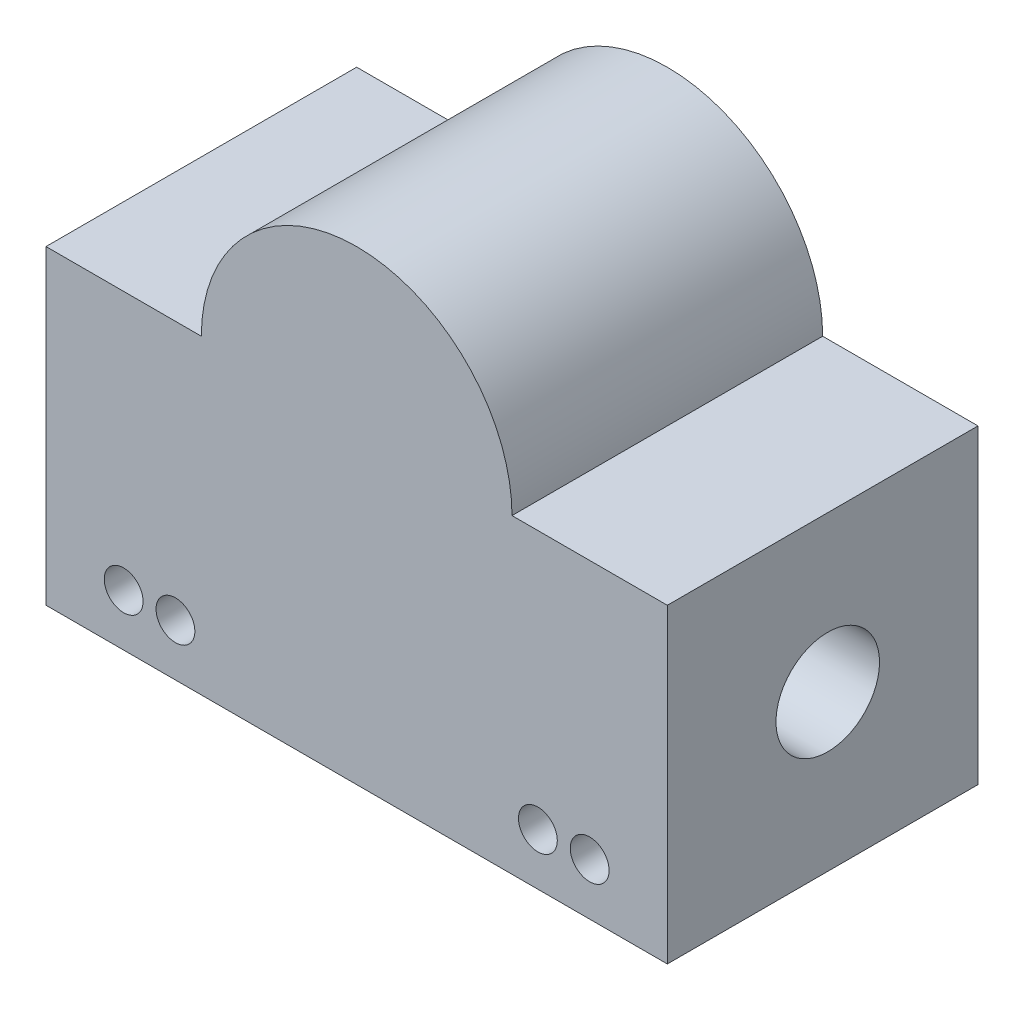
ISO-10303-21;
HEADER;
FILE_DESCRIPTION(('STEP AP214'),'2;1');
FILE_NAME('part.step','',(''),(''),'','','');
FILE_SCHEMA(('AUTOMOTIVE_DESIGN { 1 0 10303 214 1 1 1 1 }'));
ENDSEC;
DATA;
#1=APPLICATION_CONTEXT('core data for automotive mechanical design processes');
#2=APPLICATION_PROTOCOL_DEFINITION('international standard','automotive_design',2000,#1);
#3=PRODUCT_CONTEXT('',#1,'mechanical');
#4=PRODUCT('Part','Part','',(#3));
#5=PRODUCT_RELATED_PRODUCT_CATEGORY('part','',(#4));
#6=PRODUCT_DEFINITION_FORMATION('','',#4);
#7=PRODUCT_DEFINITION_CONTEXT('part definition',#1,'design');
#8=PRODUCT_DEFINITION('design','',#6,#7);
#9=PRODUCT_DEFINITION_SHAPE('','',#8);
#10=(LENGTH_UNIT() NAMED_UNIT(*) SI_UNIT(.MILLI.,.METRE.));
#11=(NAMED_UNIT(*) PLANE_ANGLE_UNIT() SI_UNIT($,.RADIAN.));
#12=(NAMED_UNIT(*) SI_UNIT($,.STERADIAN.) SOLID_ANGLE_UNIT());
#13=UNCERTAINTY_MEASURE_WITH_UNIT(LENGTH_MEASURE(1.E-05),#10,'distance_accuracy_value','');
#14=(GEOMETRIC_REPRESENTATION_CONTEXT(3) GLOBAL_UNCERTAINTY_ASSIGNED_CONTEXT((#13)) GLOBAL_UNIT_ASSIGNED_CONTEXT((#10,
#11,#12)) REPRESENTATION_CONTEXT('',''));
#15=CARTESIAN_POINT('',(0.,0.,0.));
#16=DIRECTION('',(0.,0.,1.));
#17=DIRECTION('',(1.,0.,0.));
#18=AXIS2_PLACEMENT_3D('',#15,#16,#17);
#19=CARTESIAN_POINT('',(0.,0.,38.1));
#20=DIRECTION('',(-1.,0.,0.));
#21=DIRECTION('',(0.,0.,1.));
#22=AXIS2_PLACEMENT_3D('',#19,#20,#21);
#23=PLANE('',#22);
#24=CARTESIAN_POINT('',(0.,19.05,18.4273274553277));
#25=DIRECTION('',(1.,0.,0.));
#26=DIRECTION('',(0.,0.,-1.));
#27=AXIS2_PLACEMENT_3D('',#24,#25,#26);
#28=CIRCLE('',#27,6.35);
#29=CARTESIAN_POINT('',(0.,19.05,12.0773274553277));
#30=VERTEX_POINT('',#29);
#31=EDGE_CURVE('E124',#30,#30,#28,.T.);
#32=ORIENTED_EDGE('',*,*,#31,.T.);
#33=EDGE_LOOP('',(#32));
#34=FACE_BOUND('',#33,.T.);
#35=DIRECTION('',(0.,1.,0.));
#36=VECTOR('',#35,1.);
#37=CARTESIAN_POINT('',(0.,0.,0.));
#38=LINE('',#37,#36);
#39=CARTESIAN_POINT('',(0.,0.,0.));
#40=VERTEX_POINT('',#39);
#41=CARTESIAN_POINT('',(0.,38.1,0.));
#42=VERTEX_POINT('',#41);
#43=EDGE_CURVE('E120',#40,#42,#38,.T.);
#44=ORIENTED_EDGE('',*,*,#43,.F.);
#45=DIRECTION('',(0.,0.,-1.));
#46=VECTOR('',#45,1.);
#47=CARTESIAN_POINT('',(0.,0.,38.1));
#48=LINE('',#47,#46);
#49=CARTESIAN_POINT('',(0.,0.,38.1));
#50=VERTEX_POINT('',#49);
#51=EDGE_CURVE('E11',#50,#40,#48,.T.);
#52=ORIENTED_EDGE('',*,*,#51,.F.);
#53=DIRECTION('',(0.,1.,0.));
#54=VECTOR('',#53,1.);
#55=CARTESIAN_POINT('',(0.,0.,38.1));
#56=LINE('',#55,#54);
#57=CARTESIAN_POINT('',(0.,38.1,38.1));
#58=VERTEX_POINT('',#57);
#59=EDGE_CURVE('E133',#50,#58,#56,.T.);
#60=ORIENTED_EDGE('',*,*,#59,.T.);
#61=DIRECTION('',(0.,0.,-1.));
#62=VECTOR('',#61,1.);
#63=CARTESIAN_POINT('',(0.,38.1,38.1));
#64=LINE('',#63,#62);
#65=EDGE_CURVE('E37',#58,#42,#64,.T.);
#66=ORIENTED_EDGE('',*,*,#65,.T.);
#67=EDGE_LOOP('',(#44,#52,#60,#66));
#68=FACE_BOUND('',#67,.T.);
#69=ADVANCED_FACE('F34',(#34,#68),#23,.T.);
#70=CARTESIAN_POINT('',(0.,0.,38.1));
#71=DIRECTION('',(0.,1.,0.));
#72=DIRECTION('',(0.,0.,1.));
#73=AXIS2_PLACEMENT_3D('',#70,#71,#72);
#74=PLANE('',#73);
#75=DIRECTION('',(1.,0.,0.));
#76=VECTOR('',#75,1.);
#77=CARTESIAN_POINT('',(0.,0.,0.));
#78=LINE('',#77,#76);
#79=CARTESIAN_POINT('',(76.2,0.,0.));
#80=VERTEX_POINT('',#79);
#81=EDGE_CURVE('E73',#40,#80,#78,.T.);
#82=ORIENTED_EDGE('',*,*,#81,.T.);
#83=DIRECTION('',(0.,0.,-1.));
#84=VECTOR('',#83,1.);
#85=CARTESIAN_POINT('',(76.2,0.,38.1));
#86=LINE('',#85,#84);
#87=CARTESIAN_POINT('',(76.2,0.,38.1));
#88=VERTEX_POINT('',#87);
#89=EDGE_CURVE('E43',#88,#80,#86,.T.);
#90=ORIENTED_EDGE('',*,*,#89,.F.);
#91=DIRECTION('',(1.,0.,0.));
#92=VECTOR('',#91,1.);
#93=CARTESIAN_POINT('',(0.,0.,38.1));
#94=LINE('',#93,#92);
#95=EDGE_CURVE('E98',#50,#88,#94,.T.);
#96=ORIENTED_EDGE('',*,*,#95,.F.);
#97=ORIENTED_EDGE('',*,*,#51,.T.);
#98=EDGE_LOOP('',(#82,#90,#96,#97));
#99=FACE_BOUND('',#98,.T.);
#100=ADVANCED_FACE('F204',(#99),#74,.F.);
#101=CARTESIAN_POINT('',(76.2,0.,38.1));
#102=DIRECTION('',(-1.,0.,0.));
#103=DIRECTION('',(0.,0.,1.));
#104=AXIS2_PLACEMENT_3D('',#101,#102,#103);
#105=PLANE('',#104);
#106=CARTESIAN_POINT('',(76.2,19.05,18.4273274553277));
#107=DIRECTION('',(1.,0.,0.));
#108=DIRECTION('',(0.,0.,-1.));
#109=AXIS2_PLACEMENT_3D('',#106,#107,#108);
#110=CIRCLE('',#109,6.35);
#111=CARTESIAN_POINT('',(76.2,19.05,12.0773274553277));
#112=VERTEX_POINT('',#111);
#113=EDGE_CURVE('E146',#112,#112,#110,.T.);
#114=ORIENTED_EDGE('',*,*,#113,.F.);
#115=EDGE_LOOP('',(#114));
#116=FACE_BOUND('',#115,.T.);
#117=DIRECTION('',(0.,1.,0.));
#118=VECTOR('',#117,1.);
#119=CARTESIAN_POINT('',(76.2,0.,0.));
#120=LINE('',#119,#118);
#121=CARTESIAN_POINT('',(76.2,38.1,0.));
#122=VERTEX_POINT('',#121);
#123=EDGE_CURVE('E105',#80,#122,#120,.T.);
#124=ORIENTED_EDGE('',*,*,#123,.T.);
#125=DIRECTION('',(0.,0.,-1.));
#126=VECTOR('',#125,1.);
#127=CARTESIAN_POINT('',(76.2,38.1,38.1));
#128=LINE('',#127,#126);
#129=CARTESIAN_POINT('',(76.2,38.1,38.1));
#130=VERTEX_POINT('',#129);
#131=EDGE_CURVE('E102',#130,#122,#128,.T.);
#132=ORIENTED_EDGE('',*,*,#131,.F.);
#133=DIRECTION('',(0.,1.,0.));
#134=VECTOR('',#133,1.);
#135=CARTESIAN_POINT('',(76.2,0.,38.1));
#136=LINE('',#135,#134);
#137=EDGE_CURVE('E92',#88,#130,#136,.T.);
#138=ORIENTED_EDGE('',*,*,#137,.F.);
#139=ORIENTED_EDGE('',*,*,#89,.T.);
#140=EDGE_LOOP('',(#124,#132,#138,#139));
#141=FACE_BOUND('',#140,.T.);
#142=ADVANCED_FACE('F103',(#116,#141),#105,.F.);
#143=CARTESIAN_POINT('',(57.15,38.1,38.1));
#144=DIRECTION('',(0.,1.,0.));
#145=DIRECTION('',(0.,0.,1.));
#146=AXIS2_PLACEMENT_3D('',#143,#144,#145);
#147=PLANE('',#146);
#148=DIRECTION('',(1.,0.,0.));
#149=VECTOR('',#148,1.);
#150=CARTESIAN_POINT('',(57.15,38.1,0.));
#151=LINE('',#150,#149);
#152=CARTESIAN_POINT('',(57.15,38.1,0.));
#153=VERTEX_POINT('',#152);
#154=EDGE_CURVE('E130',#153,#122,#151,.T.);
#155=ORIENTED_EDGE('',*,*,#154,.F.);
#156=DIRECTION('',(0.,0.,-1.));
#157=VECTOR('',#156,1.);
#158=CARTESIAN_POINT('',(57.15,38.1,38.1));
#159=LINE('',#158,#157);
#160=CARTESIAN_POINT('',(57.15,38.1,38.1));
#161=VERTEX_POINT('',#160);
#162=EDGE_CURVE('E109',#161,#153,#159,.T.);
#163=ORIENTED_EDGE('',*,*,#162,.F.);
#164=DIRECTION('',(1.,0.,0.));
#165=VECTOR('',#164,1.);
#166=CARTESIAN_POINT('',(57.15,38.1,38.1));
#167=LINE('',#166,#165);
#168=EDGE_CURVE('E97',#161,#130,#167,.T.);
#169=ORIENTED_EDGE('',*,*,#168,.T.);
#170=ORIENTED_EDGE('',*,*,#131,.T.);
#171=EDGE_LOOP('',(#155,#163,#169,#170));
#172=FACE_BOUND('',#171,.T.);
#173=ADVANCED_FACE('F111',(#172),#147,.T.);
#174=CARTESIAN_POINT('',(38.1,38.1,38.1));
#175=DIRECTION('',(0.,0.,-1.));
#176=DIRECTION('',(-1.,0.,0.));
#177=AXIS2_PLACEMENT_3D('',#174,#175,#176);
#178=CYLINDRICAL_SURFACE('',#177,19.05);
#179=CARTESIAN_POINT('',(38.1,38.1,0.));
#180=DIRECTION('',(0.,0.,1.));
#181=DIRECTION('',(1.,0.,0.));
#182=AXIS2_PLACEMENT_3D('',#179,#180,#181);
#183=CIRCLE('',#182,19.05);
#184=CARTESIAN_POINT('',(19.05,38.1,0.));
#185=VERTEX_POINT('',#184);
#186=EDGE_CURVE('E127',#153,#185,#183,.T.);
#187=ORIENTED_EDGE('',*,*,#186,.T.);
#188=DIRECTION('',(0.,0.,-1.));
#189=VECTOR('',#188,1.);
#190=CARTESIAN_POINT('',(19.05,38.1,38.1));
#191=LINE('',#190,#189);
#192=CARTESIAN_POINT('',(19.05,38.1,38.1));
#193=VERTEX_POINT('',#192);
#194=EDGE_CURVE('E136',#193,#185,#191,.T.);
#195=ORIENTED_EDGE('',*,*,#194,.F.);
#196=CARTESIAN_POINT('',(38.1,38.1,38.1));
#197=DIRECTION('',(0.,0.,1.));
#198=DIRECTION('',(1.,0.,0.));
#199=AXIS2_PLACEMENT_3D('',#196,#197,#198);
#200=CIRCLE('',#199,19.05);
#201=EDGE_CURVE('E113',#161,#193,#200,.T.);
#202=ORIENTED_EDGE('',*,*,#201,.F.);
#203=ORIENTED_EDGE('',*,*,#162,.T.);
#204=EDGE_LOOP('',(#187,#195,#202,#203));
#205=FACE_BOUND('',#204,.T.);
#206=ADVANCED_FACE('F143',(#205),#178,.T.);
#207=CARTESIAN_POINT('',(0.,38.1,38.1));
#208=DIRECTION('',(0.,1.,0.));
#209=DIRECTION('',(0.,0.,1.));
#210=AXIS2_PLACEMENT_3D('',#207,#208,#209);
#211=PLANE('',#210);
#212=DIRECTION('',(1.,0.,0.));
#213=VECTOR('',#212,1.);
#214=CARTESIAN_POINT('',(0.,38.1,0.));
#215=LINE('',#214,#213);
#216=EDGE_CURVE('E123',#42,#185,#215,.T.);
#217=ORIENTED_EDGE('',*,*,#216,.F.);
#218=ORIENTED_EDGE('',*,*,#65,.F.);
#219=DIRECTION('',(1.,0.,0.));
#220=VECTOR('',#219,1.);
#221=CARTESIAN_POINT('',(0.,38.1,38.1));
#222=LINE('',#221,#220);
#223=EDGE_CURVE('E115',#58,#193,#222,.T.);
#224=ORIENTED_EDGE('',*,*,#223,.T.);
#225=ORIENTED_EDGE('',*,*,#194,.T.);
#226=EDGE_LOOP('',(#217,#218,#224,#225));
#227=FACE_BOUND('',#226,.T.);
#228=ADVANCED_FACE('F138',(#227),#211,.T.);
#229=CARTESIAN_POINT('',(38.1,38.1,38.1));
#230=DIRECTION('',(0.,0.,1.));
#231=DIRECTION('',(1.,0.,0.));
#232=AXIS2_PLACEMENT_3D('',#229,#230,#231);
#233=PLANE('',#232);
#234=CARTESIAN_POINT('',(15.875,6.35000000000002,38.1));
#235=DIRECTION('',(0.,0.,1.));
#236=DIRECTION('',(1.,0.,0.));
#237=AXIS2_PLACEMENT_3D('',#234,#235,#236);
#238=CIRCLE('',#237,2.38125);
#239=CARTESIAN_POINT('',(18.25625,6.35000000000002,38.1));
#240=VERTEX_POINT('',#239);
#241=EDGE_CURVE('E155',#240,#240,#238,.T.);
#242=ORIENTED_EDGE('',*,*,#241,.F.);
#243=EDGE_LOOP('',(#242));
#244=FACE_BOUND('',#243,.T.);
#245=CARTESIAN_POINT('',(60.325,6.35000000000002,38.1));
#246=DIRECTION('',(0.,0.,1.));
#247=DIRECTION('',(1.,0.,0.));
#248=AXIS2_PLACEMENT_3D('',#245,#246,#247);
#249=CIRCLE('',#248,2.38125000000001);
#250=CARTESIAN_POINT('',(62.70625,6.35000000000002,38.1));
#251=VERTEX_POINT('',#250);
#252=EDGE_CURVE('E167',#251,#251,#249,.T.);
#253=ORIENTED_EDGE('',*,*,#252,.F.);
#254=EDGE_LOOP('',(#253));
#255=FACE_BOUND('',#254,.T.);
#256=CARTESIAN_POINT('',(66.675,6.35000000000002,38.1));
#257=DIRECTION('',(0.,0.,1.));
#258=DIRECTION('',(1.,0.,0.));
#259=AXIS2_PLACEMENT_3D('',#256,#257,#258);
#260=CIRCLE('',#259,2.38125000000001);
#261=CARTESIAN_POINT('',(69.05625,6.35000000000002,38.1));
#262=VERTEX_POINT('',#261);
#263=EDGE_CURVE('E161',#262,#262,#260,.T.);
#264=ORIENTED_EDGE('',*,*,#263,.F.);
#265=EDGE_LOOP('',(#264));
#266=FACE_BOUND('',#265,.T.);
#267=CARTESIAN_POINT('',(9.525,6.35000000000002,38.1));
#268=DIRECTION('',(0.,0.,1.));
#269=DIRECTION('',(1.,0.,0.));
#270=AXIS2_PLACEMENT_3D('',#267,#268,#269);
#271=CIRCLE('',#270,2.38125);
#272=CARTESIAN_POINT('',(11.90625,6.35000000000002,38.1));
#273=VERTEX_POINT('',#272);
#274=EDGE_CURVE('E152',#273,#273,#271,.T.);
#275=ORIENTED_EDGE('',*,*,#274,.F.);
#276=EDGE_LOOP('',(#275));
#277=FACE_BOUND('',#276,.T.);
#278=ORIENTED_EDGE('',*,*,#59,.F.);
#279=ORIENTED_EDGE('',*,*,#95,.T.);
#280=ORIENTED_EDGE('',*,*,#137,.T.);
#281=ORIENTED_EDGE('',*,*,#168,.F.);
#282=ORIENTED_EDGE('',*,*,#201,.T.);
#283=ORIENTED_EDGE('',*,*,#223,.F.);
#284=EDGE_LOOP('',(#278,#279,#280,#281,#282,#283));
#285=FACE_BOUND('',#284,.T.);
#286=ADVANCED_FACE('F95',(#244,#255,#266,#277,#285),#233,.T.);
#287=CARTESIAN_POINT('',(38.1,38.1,0.));
#288=DIRECTION('',(0.,0.,1.));
#289=DIRECTION('',(1.,0.,0.));
#290=AXIS2_PLACEMENT_3D('',#287,#288,#289);
#291=PLANE('',#290);
#292=CARTESIAN_POINT('',(15.875,6.35000000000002,0.));
#293=DIRECTION('',(0.,0.,1.));
#294=DIRECTION('',(1.,0.,0.));
#295=AXIS2_PLACEMENT_3D('',#292,#293,#294);
#296=CIRCLE('',#295,2.38125);
#297=CARTESIAN_POINT('',(18.25625,6.35000000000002,0.));
#298=VERTEX_POINT('',#297);
#299=EDGE_CURVE('E170',#298,#298,#296,.T.);
#300=ORIENTED_EDGE('',*,*,#299,.T.);
#301=EDGE_LOOP('',(#300));
#302=FACE_BOUND('',#301,.T.);
#303=CARTESIAN_POINT('',(60.325,6.35000000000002,0.));
#304=DIRECTION('',(0.,0.,1.));
#305=DIRECTION('',(1.,0.,0.));
#306=AXIS2_PLACEMENT_3D('',#303,#304,#305);
#307=CIRCLE('',#306,2.38125000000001);
#308=CARTESIAN_POINT('',(62.70625,6.35000000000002,0.));
#309=VERTEX_POINT('',#308);
#310=EDGE_CURVE('E164',#309,#309,#307,.T.);
#311=ORIENTED_EDGE('',*,*,#310,.T.);
#312=EDGE_LOOP('',(#311));
#313=FACE_BOUND('',#312,.T.);
#314=CARTESIAN_POINT('',(66.675,6.35000000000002,0.));
#315=DIRECTION('',(0.,0.,1.));
#316=DIRECTION('',(1.,0.,0.));
#317=AXIS2_PLACEMENT_3D('',#314,#315,#316);
#318=CIRCLE('',#317,2.38125000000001);
#319=CARTESIAN_POINT('',(69.05625,6.35000000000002,0.));
#320=VERTEX_POINT('',#319);
#321=EDGE_CURVE('E158',#320,#320,#318,.T.);
#322=ORIENTED_EDGE('',*,*,#321,.T.);
#323=EDGE_LOOP('',(#322));
#324=FACE_BOUND('',#323,.T.);
#325=CARTESIAN_POINT('',(9.525,6.35000000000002,0.));
#326=DIRECTION('',(0.,0.,1.));
#327=DIRECTION('',(1.,0.,0.));
#328=AXIS2_PLACEMENT_3D('',#325,#326,#327);
#329=CIRCLE('',#328,2.38125);
#330=CARTESIAN_POINT('',(11.90625,6.35000000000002,0.));
#331=VERTEX_POINT('',#330);
#332=EDGE_CURVE('E149',#331,#331,#329,.T.);
#333=ORIENTED_EDGE('',*,*,#332,.T.);
#334=EDGE_LOOP('',(#333));
#335=FACE_BOUND('',#334,.T.);
#336=ORIENTED_EDGE('',*,*,#43,.T.);
#337=ORIENTED_EDGE('',*,*,#216,.T.);
#338=ORIENTED_EDGE('',*,*,#186,.F.);
#339=ORIENTED_EDGE('',*,*,#154,.T.);
#340=ORIENTED_EDGE('',*,*,#123,.F.);
#341=ORIENTED_EDGE('',*,*,#81,.F.);
#342=EDGE_LOOP('',(#336,#337,#338,#339,#340,#341));
#343=FACE_BOUND('',#342,.T.);
#344=ADVANCED_FACE('F141',(#302,#313,#324,#335,#343),#291,.F.);
#345=CARTESIAN_POINT('',(0.,19.05,18.4273274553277));
#346=DIRECTION('',(1.,0.,0.));
#347=DIRECTION('',(0.,0.,-1.));
#348=AXIS2_PLACEMENT_3D('',#345,#346,#347);
#349=CYLINDRICAL_SURFACE('',#348,6.35);
#350=CARTESIAN_POINT('',(0.,19.05,12.0773274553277));
#351=CARTESIAN_POINT('',(0.79375,19.05,12.0773274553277));
#352=CARTESIAN_POINT('',(1.5875,19.05,12.0773274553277));
#353=CARTESIAN_POINT('',(3.175,19.05,12.0773274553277));
#354=CARTESIAN_POINT('',(3.96875,19.05,12.0773274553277));
#355=CARTESIAN_POINT('',(5.55625,19.05,12.0773274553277));
#356=CARTESIAN_POINT('',(6.35,19.05,12.0773274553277));
#357=CARTESIAN_POINT('',(7.9375,19.05,12.0773274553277));
#358=CARTESIAN_POINT('',(8.73125,19.05,12.0773274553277));
#359=CARTESIAN_POINT('',(10.31875,19.05,12.0773274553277));
#360=CARTESIAN_POINT('',(11.1125,19.05,12.0773274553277));
#361=CARTESIAN_POINT('',(12.7,19.05,12.0773274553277));
#362=CARTESIAN_POINT('',(13.49375,19.05,12.0773274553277));
#363=CARTESIAN_POINT('',(15.08125,19.05,12.0773274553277));
#364=CARTESIAN_POINT('',(15.875,19.05,12.0773274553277));
#365=CARTESIAN_POINT('',(17.4625,19.05,12.0773274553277));
#366=CARTESIAN_POINT('',(18.25625,19.05,12.0773274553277));
#367=CARTESIAN_POINT('',(19.84375,19.05,12.0773274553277));
#368=CARTESIAN_POINT('',(20.6375,19.05,12.0773274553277));
#369=CARTESIAN_POINT('',(22.225,19.05,12.0773274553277));
#370=CARTESIAN_POINT('',(23.01875,19.05,12.0773274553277));
#371=CARTESIAN_POINT('',(24.60625,19.05,12.0773274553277));
#372=CARTESIAN_POINT('',(25.4,19.05,12.0773274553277));
#373=CARTESIAN_POINT('',(26.9875,19.05,12.0773274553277));
#374=CARTESIAN_POINT('',(27.78125,19.05,12.0773274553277));
#375=CARTESIAN_POINT('',(29.36875,19.05,12.0773274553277));
#376=CARTESIAN_POINT('',(30.1625,19.05,12.0773274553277));
#377=CARTESIAN_POINT('',(31.75,19.05,12.0773274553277));
#378=CARTESIAN_POINT('',(32.54375,19.05,12.0773274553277));
#379=CARTESIAN_POINT('',(34.13125,19.05,12.0773274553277));
#380=CARTESIAN_POINT('',(34.925,19.05,12.0773274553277));
#381=CARTESIAN_POINT('',(36.5125,19.05,12.0773274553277));
#382=CARTESIAN_POINT('',(37.30625,19.05,12.0773274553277));
#383=CARTESIAN_POINT('',(38.89375,19.05,12.0773274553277));
#384=CARTESIAN_POINT('',(39.6875,19.05,12.0773274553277));
#385=CARTESIAN_POINT('',(41.275,19.05,12.0773274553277));
#386=CARTESIAN_POINT('',(42.06875,19.05,12.0773274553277));
#387=CARTESIAN_POINT('',(43.65625,19.05,12.0773274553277));
#388=CARTESIAN_POINT('',(44.45,19.05,12.0773274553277));
#389=CARTESIAN_POINT('',(46.0375,19.05,12.0773274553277));
#390=CARTESIAN_POINT('',(46.83125,19.05,12.0773274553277));
#391=CARTESIAN_POINT('',(48.41875,19.05,12.0773274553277));
#392=CARTESIAN_POINT('',(49.2125,19.05,12.0773274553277));
#393=CARTESIAN_POINT('',(50.8,19.05,12.0773274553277));
#394=CARTESIAN_POINT('',(51.59375,19.05,12.0773274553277));
#395=CARTESIAN_POINT('',(53.18125,19.05,12.0773274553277));
#396=CARTESIAN_POINT('',(53.975,19.05,12.0773274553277));
#397=CARTESIAN_POINT('',(55.5625,19.05,12.0773274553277));
#398=CARTESIAN_POINT('',(56.35625,19.05,12.0773274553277));
#399=CARTESIAN_POINT('',(57.94375,19.05,12.0773274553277));
#400=CARTESIAN_POINT('',(58.7375,19.05,12.0773274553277));
#401=CARTESIAN_POINT('',(60.325,19.05,12.0773274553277));
#402=CARTESIAN_POINT('',(61.11875,19.05,12.0773274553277));
#403=CARTESIAN_POINT('',(62.70625,19.05,12.0773274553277));
#404=CARTESIAN_POINT('',(63.5,19.05,12.0773274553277));
#405=CARTESIAN_POINT('',(65.0875,19.05,12.0773274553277));
#406=CARTESIAN_POINT('',(65.88125,19.05,12.0773274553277));
#407=CARTESIAN_POINT('',(67.46875,19.05,12.0773274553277));
#408=CARTESIAN_POINT('',(68.2625,19.05,12.0773274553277));
#409=CARTESIAN_POINT('',(69.85,19.05,12.0773274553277));
#410=CARTESIAN_POINT('',(70.64375,19.05,12.0773274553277));
#411=CARTESIAN_POINT('',(72.23125,19.05,12.0773274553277));
#412=CARTESIAN_POINT('',(73.025,19.05,12.0773274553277));
#413=CARTESIAN_POINT('',(74.6125,19.05,12.0773274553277));
#414=CARTESIAN_POINT('',(75.40625,19.05,12.0773274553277));
#415=CARTESIAN_POINT('',(76.2,19.05,12.0773274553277));
#416=B_SPLINE_CURVE_WITH_KNOTS('',3,(#350,#351,#352,#353,#354,#355,#356,#357,#358,#359,#360,
#361,#362,#363,#364,#365,#366,#367,#368,#369,#370,#371,#372,#373,#374,#375,#376,#377,#378,#379,
#380,#381,#382,#383,#384,#385,#386,#387,#388,#389,#390,#391,#392,#393,#394,#395,#396,#397,#398,
#399,#400,#401,#402,#403,#404,#405,#406,#407,#408,#409,#410,#411,#412,#413,#414,#415),
.UNSPECIFIED.,.F.,.F.,(4,2,2,2,2,2,2,2,2,2,2,2,2,2,2,2,2,2,2,2,2,2,2,2,2,2,2,2,2,2,2,2,4),(0.,
2.38125,4.7625,7.14375,9.525,11.90625,14.2875,16.66875,19.05,21.43125,23.8125,26.19375,28.575,
30.95625,33.3375,35.71875,38.1,40.48125,42.8625,45.24375,47.625,50.00625,52.3875,54.76875,57.15,
59.53125,61.9125,64.29375,66.675,69.05625,71.4375,73.81875,76.2),.UNSPECIFIED.);
#417=EDGE_CURVE('BSEAM190',#30,#112,#416,.T.);
#418=ORIENTED_EDGE('',*,*,#31,.F.);
#419=ORIENTED_EDGE('',*,*,#113,.T.);
#420=ORIENTED_EDGE('',*,*,#417,.T.);
#421=ORIENTED_EDGE('',*,*,#417,.F.);
#422=EDGE_LOOP('',(#418,#420,#419,#421));
#423=FACE_BOUND('',#422,.T.);
#424=ADVANCED_FACE('F190',(#423),#349,.F.);
#425=CARTESIAN_POINT('',(9.525,6.35000000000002,0.));
#426=DIRECTION('',(0.,0.,1.));
#427=DIRECTION('',(1.,0.,0.));
#428=AXIS2_PLACEMENT_3D('',#425,#426,#427);
#429=CYLINDRICAL_SURFACE('',#428,2.38125);
#430=CARTESIAN_POINT('',(11.90625,6.35000000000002,0.));
#431=CARTESIAN_POINT('',(11.90625,6.35000000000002,0.396875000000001));
#432=CARTESIAN_POINT('',(11.90625,6.35000000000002,0.793750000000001));
#433=CARTESIAN_POINT('',(11.90625,6.35000000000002,1.5875));
#434=CARTESIAN_POINT('',(11.90625,6.35000000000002,1.984375));
#435=CARTESIAN_POINT('',(11.90625,6.35000000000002,2.778125));
#436=CARTESIAN_POINT('',(11.90625,6.35000000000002,3.175));
#437=CARTESIAN_POINT('',(11.90625,6.35000000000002,3.96875));
#438=CARTESIAN_POINT('',(11.90625,6.35000000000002,4.365625));
#439=CARTESIAN_POINT('',(11.90625,6.35000000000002,5.159375));
#440=CARTESIAN_POINT('',(11.90625,6.35000000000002,5.55625));
#441=CARTESIAN_POINT('',(11.90625,6.35000000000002,6.35));
#442=CARTESIAN_POINT('',(11.90625,6.35000000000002,6.746875));
#443=CARTESIAN_POINT('',(11.90625,6.35000000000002,7.540625));
#444=CARTESIAN_POINT('',(11.90625,6.35000000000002,7.9375));
#445=CARTESIAN_POINT('',(11.90625,6.35000000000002,8.73125));
#446=CARTESIAN_POINT('',(11.90625,6.35000000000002,9.128125));
#447=CARTESIAN_POINT('',(11.90625,6.35000000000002,9.921875));
#448=CARTESIAN_POINT('',(11.90625,6.35000000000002,10.31875));
#449=CARTESIAN_POINT('',(11.90625,6.35000000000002,11.1125));
#450=CARTESIAN_POINT('',(11.90625,6.35000000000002,11.509375));
#451=CARTESIAN_POINT('',(11.90625,6.35000000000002,12.303125));
#452=CARTESIAN_POINT('',(11.90625,6.35000000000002,12.7));
#453=CARTESIAN_POINT('',(11.90625,6.35000000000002,13.49375));
#454=CARTESIAN_POINT('',(11.90625,6.35000000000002,13.890625));
#455=CARTESIAN_POINT('',(11.90625,6.35000000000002,14.684375));
#456=CARTESIAN_POINT('',(11.90625,6.35000000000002,15.08125));
#457=CARTESIAN_POINT('',(11.90625,6.35000000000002,15.875));
#458=CARTESIAN_POINT('',(11.90625,6.35000000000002,16.271875));
#459=CARTESIAN_POINT('',(11.90625,6.35000000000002,17.065625));
#460=CARTESIAN_POINT('',(11.90625,6.35000000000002,17.4625));
#461=CARTESIAN_POINT('',(11.90625,6.35000000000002,18.25625));
#462=CARTESIAN_POINT('',(11.90625,6.35000000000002,18.653125));
#463=CARTESIAN_POINT('',(11.90625,6.35000000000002,19.446875));
#464=CARTESIAN_POINT('',(11.90625,6.35000000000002,19.84375));
#465=CARTESIAN_POINT('',(11.90625,6.35000000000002,20.6375));
#466=CARTESIAN_POINT('',(11.90625,6.35000000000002,21.034375));
#467=CARTESIAN_POINT('',(11.90625,6.35000000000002,21.828125));
#468=CARTESIAN_POINT('',(11.90625,6.35000000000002,22.225));
#469=CARTESIAN_POINT('',(11.90625,6.35000000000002,23.01875));
#470=CARTESIAN_POINT('',(11.90625,6.35000000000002,23.415625));
#471=CARTESIAN_POINT('',(11.90625,6.35000000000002,24.209375));
#472=CARTESIAN_POINT('',(11.90625,6.35000000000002,24.60625));
#473=CARTESIAN_POINT('',(11.90625,6.35000000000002,25.4));
#474=CARTESIAN_POINT('',(11.90625,6.35000000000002,25.796875));
#475=CARTESIAN_POINT('',(11.90625,6.35000000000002,26.590625));
#476=CARTESIAN_POINT('',(11.90625,6.35000000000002,26.9875));
#477=CARTESIAN_POINT('',(11.90625,6.35000000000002,27.78125));
#478=CARTESIAN_POINT('',(11.90625,6.35000000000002,28.178125));
#479=CARTESIAN_POINT('',(11.90625,6.35000000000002,28.971875));
#480=CARTESIAN_POINT('',(11.90625,6.35000000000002,29.36875));
#481=CARTESIAN_POINT('',(11.90625,6.35000000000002,30.1625));
#482=CARTESIAN_POINT('',(11.90625,6.35000000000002,30.559375));
#483=CARTESIAN_POINT('',(11.90625,6.35000000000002,31.353125));
#484=CARTESIAN_POINT('',(11.90625,6.35000000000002,31.75));
#485=CARTESIAN_POINT('',(11.90625,6.35000000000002,32.54375));
#486=CARTESIAN_POINT('',(11.90625,6.35000000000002,32.940625));
#487=CARTESIAN_POINT('',(11.90625,6.35000000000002,33.734375));
#488=CARTESIAN_POINT('',(11.90625,6.35000000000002,34.13125));
#489=CARTESIAN_POINT('',(11.90625,6.35000000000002,34.925));
#490=CARTESIAN_POINT('',(11.90625,6.35000000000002,35.321875));
#491=CARTESIAN_POINT('',(11.90625,6.35000000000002,36.115625));
#492=CARTESIAN_POINT('',(11.90625,6.35000000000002,36.5125));
#493=CARTESIAN_POINT('',(11.90625,6.35000000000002,37.30625));
#494=CARTESIAN_POINT('',(11.90625,6.35000000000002,37.703125));
#495=CARTESIAN_POINT('',(11.90625,6.35000000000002,38.1));
#496=B_SPLINE_CURVE_WITH_KNOTS('',3,(#430,#431,#432,#433,#434,#435,#436,#437,#438,#439,#440,
#441,#442,#443,#444,#445,#446,#447,#448,#449,#450,#451,#452,#453,#454,#455,#456,#457,#458,#459,
#460,#461,#462,#463,#464,#465,#466,#467,#468,#469,#470,#471,#472,#473,#474,#475,#476,#477,#478,
#479,#480,#481,#482,#483,#484,#485,#486,#487,#488,#489,#490,#491,#492,#493,#494,#495),
.UNSPECIFIED.,.F.,.F.,(4,2,2,2,2,2,2,2,2,2,2,2,2,2,2,2,2,2,2,2,2,2,2,2,2,2,2,2,2,2,2,2,4),(0.,
1.190625,2.38125,3.571875,4.7625,5.953125,7.14375,8.334375,9.525,10.715625,11.90625,13.096875,
14.2875,15.478125,16.66875,17.859375,19.05,20.240625,21.43125,22.621875,23.8125,25.003125,
26.19375,27.384375,28.575,29.765625,30.95625,32.146875,33.3375,34.528125,35.71875,36.909375,
38.1),.UNSPECIFIED.);
#497=EDGE_CURVE('BSEAM187',#331,#273,#496,.T.);
#498=ORIENTED_EDGE('',*,*,#332,.F.);
#499=ORIENTED_EDGE('',*,*,#274,.T.);
#500=ORIENTED_EDGE('',*,*,#497,.T.);
#501=ORIENTED_EDGE('',*,*,#497,.F.);
#502=EDGE_LOOP('',(#498,#500,#499,#501));
#503=FACE_BOUND('',#502,.T.);
#504=ADVANCED_FACE('F187',(#503),#429,.F.);
#505=CARTESIAN_POINT('',(66.675,6.35000000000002,0.));
#506=DIRECTION('',(0.,0.,1.));
#507=DIRECTION('',(1.,0.,0.));
#508=AXIS2_PLACEMENT_3D('',#505,#506,#507);
#509=CYLINDRICAL_SURFACE('',#508,2.38125000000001);
#510=CARTESIAN_POINT('',(69.05625,6.35000000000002,0.));
#511=CARTESIAN_POINT('',(69.05625,6.35000000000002,0.396875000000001));
#512=CARTESIAN_POINT('',(69.05625,6.35000000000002,0.793750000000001));
#513=CARTESIAN_POINT('',(69.05625,6.35000000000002,1.5875));
#514=CARTESIAN_POINT('',(69.05625,6.35000000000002,1.984375));
#515=CARTESIAN_POINT('',(69.05625,6.35000000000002,2.778125));
#516=CARTESIAN_POINT('',(69.05625,6.35000000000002,3.175));
#517=CARTESIAN_POINT('',(69.05625,6.35000000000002,3.96875));
#518=CARTESIAN_POINT('',(69.05625,6.35000000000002,4.365625));
#519=CARTESIAN_POINT('',(69.05625,6.35000000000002,5.159375));
#520=CARTESIAN_POINT('',(69.05625,6.35000000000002,5.55625));
#521=CARTESIAN_POINT('',(69.05625,6.35000000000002,6.35));
#522=CARTESIAN_POINT('',(69.05625,6.35000000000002,6.746875));
#523=CARTESIAN_POINT('',(69.05625,6.35000000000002,7.540625));
#524=CARTESIAN_POINT('',(69.05625,6.35000000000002,7.9375));
#525=CARTESIAN_POINT('',(69.05625,6.35000000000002,8.73125));
#526=CARTESIAN_POINT('',(69.05625,6.35000000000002,9.128125));
#527=CARTESIAN_POINT('',(69.05625,6.35000000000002,9.921875));
#528=CARTESIAN_POINT('',(69.05625,6.35000000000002,10.31875));
#529=CARTESIAN_POINT('',(69.05625,6.35000000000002,11.1125));
#530=CARTESIAN_POINT('',(69.05625,6.35000000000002,11.509375));
#531=CARTESIAN_POINT('',(69.05625,6.35000000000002,12.303125));
#532=CARTESIAN_POINT('',(69.05625,6.35000000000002,12.7));
#533=CARTESIAN_POINT('',(69.05625,6.35000000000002,13.49375));
#534=CARTESIAN_POINT('',(69.05625,6.35000000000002,13.890625));
#535=CARTESIAN_POINT('',(69.05625,6.35000000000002,14.684375));
#536=CARTESIAN_POINT('',(69.05625,6.35000000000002,15.08125));
#537=CARTESIAN_POINT('',(69.05625,6.35000000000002,15.875));
#538=CARTESIAN_POINT('',(69.05625,6.35000000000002,16.271875));
#539=CARTESIAN_POINT('',(69.05625,6.35000000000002,17.065625));
#540=CARTESIAN_POINT('',(69.05625,6.35000000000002,17.4625));
#541=CARTESIAN_POINT('',(69.05625,6.35000000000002,18.25625));
#542=CARTESIAN_POINT('',(69.05625,6.35000000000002,18.653125));
#543=CARTESIAN_POINT('',(69.05625,6.35000000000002,19.446875));
#544=CARTESIAN_POINT('',(69.05625,6.35000000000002,19.84375));
#545=CARTESIAN_POINT('',(69.05625,6.35000000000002,20.6375));
#546=CARTESIAN_POINT('',(69.05625,6.35000000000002,21.034375));
#547=CARTESIAN_POINT('',(69.05625,6.35000000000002,21.828125));
#548=CARTESIAN_POINT('',(69.05625,6.35000000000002,22.225));
#549=CARTESIAN_POINT('',(69.05625,6.35000000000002,23.01875));
#550=CARTESIAN_POINT('',(69.05625,6.35000000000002,23.415625));
#551=CARTESIAN_POINT('',(69.05625,6.35000000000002,24.209375));
#552=CARTESIAN_POINT('',(69.05625,6.35000000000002,24.60625));
#553=CARTESIAN_POINT('',(69.05625,6.35000000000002,25.4));
#554=CARTESIAN_POINT('',(69.05625,6.35000000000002,25.796875));
#555=CARTESIAN_POINT('',(69.05625,6.35000000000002,26.590625));
#556=CARTESIAN_POINT('',(69.05625,6.35000000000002,26.9875));
#557=CARTESIAN_POINT('',(69.05625,6.35000000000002,27.78125));
#558=CARTESIAN_POINT('',(69.05625,6.35000000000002,28.178125));
#559=CARTESIAN_POINT('',(69.05625,6.35000000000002,28.971875));
#560=CARTESIAN_POINT('',(69.05625,6.35000000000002,29.36875));
#561=CARTESIAN_POINT('',(69.05625,6.35000000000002,30.1625));
#562=CARTESIAN_POINT('',(69.05625,6.35000000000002,30.559375));
#563=CARTESIAN_POINT('',(69.05625,6.35000000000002,31.353125));
#564=CARTESIAN_POINT('',(69.05625,6.35000000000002,31.75));
#565=CARTESIAN_POINT('',(69.05625,6.35000000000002,32.54375));
#566=CARTESIAN_POINT('',(69.05625,6.35000000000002,32.940625));
#567=CARTESIAN_POINT('',(69.05625,6.35000000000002,33.734375));
#568=CARTESIAN_POINT('',(69.05625,6.35000000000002,34.13125));
#569=CARTESIAN_POINT('',(69.05625,6.35000000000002,34.925));
#570=CARTESIAN_POINT('',(69.05625,6.35000000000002,35.321875));
#571=CARTESIAN_POINT('',(69.05625,6.35000000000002,36.115625));
#572=CARTESIAN_POINT('',(69.05625,6.35000000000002,36.5125));
#573=CARTESIAN_POINT('',(69.05625,6.35000000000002,37.30625));
#574=CARTESIAN_POINT('',(69.05625,6.35000000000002,37.703125));
#575=CARTESIAN_POINT('',(69.05625,6.35000000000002,38.1));
#576=B_SPLINE_CURVE_WITH_KNOTS('',3,(#510,#511,#512,#513,#514,#515,#516,#517,#518,#519,#520,
#521,#522,#523,#524,#525,#526,#527,#528,#529,#530,#531,#532,#533,#534,#535,#536,#537,#538,#539,
#540,#541,#542,#543,#544,#545,#546,#547,#548,#549,#550,#551,#552,#553,#554,#555,#556,#557,#558,
#559,#560,#561,#562,#563,#564,#565,#566,#567,#568,#569,#570,#571,#572,#573,#574,#575),
.UNSPECIFIED.,.F.,.F.,(4,2,2,2,2,2,2,2,2,2,2,2,2,2,2,2,2,2,2,2,2,2,2,2,2,2,2,2,2,2,2,2,4),(0.,
1.190625,2.38125,3.571875,4.7625,5.953125,7.14375,8.334375,9.525,10.715625,11.90625,13.096875,
14.2875,15.478125,16.66875,17.859375,19.05,20.240625,21.43125,22.621875,23.8125,25.003125,
26.19375,27.384375,28.575,29.765625,30.95625,32.146875,33.3375,34.528125,35.71875,36.909375,
38.1),.UNSPECIFIED.);
#577=EDGE_CURVE('BSEAM189',#320,#262,#576,.T.);
#578=ORIENTED_EDGE('',*,*,#321,.F.);
#579=ORIENTED_EDGE('',*,*,#263,.T.);
#580=ORIENTED_EDGE('',*,*,#577,.T.);
#581=ORIENTED_EDGE('',*,*,#577,.F.);
#582=EDGE_LOOP('',(#578,#580,#579,#581));
#583=FACE_BOUND('',#582,.T.);
#584=ADVANCED_FACE('F189',(#583),#509,.F.);
#585=CARTESIAN_POINT('',(60.325,6.35000000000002,0.));
#586=DIRECTION('',(0.,0.,1.));
#587=DIRECTION('',(1.,0.,0.));
#588=AXIS2_PLACEMENT_3D('',#585,#586,#587);
#589=CYLINDRICAL_SURFACE('',#588,2.38125000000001);
#590=CARTESIAN_POINT('',(62.70625,6.35000000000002,0.));
#591=CARTESIAN_POINT('',(62.70625,6.35000000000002,0.396875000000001));
#592=CARTESIAN_POINT('',(62.70625,6.35000000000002,0.793750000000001));
#593=CARTESIAN_POINT('',(62.70625,6.35000000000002,1.5875));
#594=CARTESIAN_POINT('',(62.70625,6.35000000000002,1.984375));
#595=CARTESIAN_POINT('',(62.70625,6.35000000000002,2.778125));
#596=CARTESIAN_POINT('',(62.70625,6.35000000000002,3.175));
#597=CARTESIAN_POINT('',(62.70625,6.35000000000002,3.96875));
#598=CARTESIAN_POINT('',(62.70625,6.35000000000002,4.365625));
#599=CARTESIAN_POINT('',(62.70625,6.35000000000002,5.159375));
#600=CARTESIAN_POINT('',(62.70625,6.35000000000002,5.55625));
#601=CARTESIAN_POINT('',(62.70625,6.35000000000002,6.35));
#602=CARTESIAN_POINT('',(62.70625,6.35000000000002,6.746875));
#603=CARTESIAN_POINT('',(62.70625,6.35000000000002,7.540625));
#604=CARTESIAN_POINT('',(62.70625,6.35000000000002,7.9375));
#605=CARTESIAN_POINT('',(62.70625,6.35000000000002,8.73125));
#606=CARTESIAN_POINT('',(62.70625,6.35000000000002,9.128125));
#607=CARTESIAN_POINT('',(62.70625,6.35000000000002,9.921875));
#608=CARTESIAN_POINT('',(62.70625,6.35000000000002,10.31875));
#609=CARTESIAN_POINT('',(62.70625,6.35000000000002,11.1125));
#610=CARTESIAN_POINT('',(62.70625,6.35000000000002,11.509375));
#611=CARTESIAN_POINT('',(62.70625,6.35000000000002,12.303125));
#612=CARTESIAN_POINT('',(62.70625,6.35000000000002,12.7));
#613=CARTESIAN_POINT('',(62.70625,6.35000000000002,13.49375));
#614=CARTESIAN_POINT('',(62.70625,6.35000000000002,13.890625));
#615=CARTESIAN_POINT('',(62.70625,6.35000000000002,14.684375));
#616=CARTESIAN_POINT('',(62.70625,6.35000000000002,15.08125));
#617=CARTESIAN_POINT('',(62.70625,6.35000000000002,15.875));
#618=CARTESIAN_POINT('',(62.70625,6.35000000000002,16.271875));
#619=CARTESIAN_POINT('',(62.70625,6.35000000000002,17.065625));
#620=CARTESIAN_POINT('',(62.70625,6.35000000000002,17.4625));
#621=CARTESIAN_POINT('',(62.70625,6.35000000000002,18.25625));
#622=CARTESIAN_POINT('',(62.70625,6.35000000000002,18.653125));
#623=CARTESIAN_POINT('',(62.70625,6.35000000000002,19.446875));
#624=CARTESIAN_POINT('',(62.70625,6.35000000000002,19.84375));
#625=CARTESIAN_POINT('',(62.70625,6.35000000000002,20.6375));
#626=CARTESIAN_POINT('',(62.70625,6.35000000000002,21.034375));
#627=CARTESIAN_POINT('',(62.70625,6.35000000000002,21.828125));
#628=CARTESIAN_POINT('',(62.70625,6.35000000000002,22.225));
#629=CARTESIAN_POINT('',(62.70625,6.35000000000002,23.01875));
#630=CARTESIAN_POINT('',(62.70625,6.35000000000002,23.415625));
#631=CARTESIAN_POINT('',(62.70625,6.35000000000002,24.209375));
#632=CARTESIAN_POINT('',(62.70625,6.35000000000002,24.60625));
#633=CARTESIAN_POINT('',(62.70625,6.35000000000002,25.4));
#634=CARTESIAN_POINT('',(62.70625,6.35000000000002,25.796875));
#635=CARTESIAN_POINT('',(62.70625,6.35000000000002,26.590625));
#636=CARTESIAN_POINT('',(62.70625,6.35000000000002,26.9875));
#637=CARTESIAN_POINT('',(62.70625,6.35000000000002,27.78125));
#638=CARTESIAN_POINT('',(62.70625,6.35000000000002,28.178125));
#639=CARTESIAN_POINT('',(62.70625,6.35000000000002,28.971875));
#640=CARTESIAN_POINT('',(62.70625,6.35000000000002,29.36875));
#641=CARTESIAN_POINT('',(62.70625,6.35000000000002,30.1625));
#642=CARTESIAN_POINT('',(62.70625,6.35000000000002,30.559375));
#643=CARTESIAN_POINT('',(62.70625,6.35000000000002,31.353125));
#644=CARTESIAN_POINT('',(62.70625,6.35000000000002,31.75));
#645=CARTESIAN_POINT('',(62.70625,6.35000000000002,32.54375));
#646=CARTESIAN_POINT('',(62.70625,6.35000000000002,32.940625));
#647=CARTESIAN_POINT('',(62.70625,6.35000000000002,33.734375));
#648=CARTESIAN_POINT('',(62.70625,6.35000000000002,34.13125));
#649=CARTESIAN_POINT('',(62.70625,6.35000000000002,34.925));
#650=CARTESIAN_POINT('',(62.70625,6.35000000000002,35.321875));
#651=CARTESIAN_POINT('',(62.70625,6.35000000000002,36.115625));
#652=CARTESIAN_POINT('',(62.70625,6.35000000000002,36.5125));
#653=CARTESIAN_POINT('',(62.70625,6.35000000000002,37.30625));
#654=CARTESIAN_POINT('',(62.70625,6.35000000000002,37.703125));
#655=CARTESIAN_POINT('',(62.70625,6.35000000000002,38.1));
#656=B_SPLINE_CURVE_WITH_KNOTS('',3,(#590,#591,#592,#593,#594,#595,#596,#597,#598,#599,#600,
#601,#602,#603,#604,#605,#606,#607,#608,#609,#610,#611,#612,#613,#614,#615,#616,#617,#618,#619,
#620,#621,#622,#623,#624,#625,#626,#627,#628,#629,#630,#631,#632,#633,#634,#635,#636,#637,#638,
#639,#640,#641,#642,#643,#644,#645,#646,#647,#648,#649,#650,#651,#652,#653,#654,#655),
.UNSPECIFIED.,.F.,.F.,(4,2,2,2,2,2,2,2,2,2,2,2,2,2,2,2,2,2,2,2,2,2,2,2,2,2,2,2,2,2,2,2,4),(0.,
1.190625,2.38125,3.571875,4.7625,5.953125,7.14375,8.334375,9.525,10.715625,11.90625,13.096875,
14.2875,15.478125,16.66875,17.859375,19.05,20.240625,21.43125,22.621875,23.8125,25.003125,
26.19375,27.384375,28.575,29.765625,30.95625,32.146875,33.3375,34.528125,35.71875,36.909375,
38.1),.UNSPECIFIED.);
#657=EDGE_CURVE('BSEAM197',#309,#251,#656,.T.);
#658=ORIENTED_EDGE('',*,*,#310,.F.);
#659=ORIENTED_EDGE('',*,*,#252,.T.);
#660=ORIENTED_EDGE('',*,*,#657,.T.);
#661=ORIENTED_EDGE('',*,*,#657,.F.);
#662=EDGE_LOOP('',(#658,#660,#659,#661));
#663=FACE_BOUND('',#662,.T.);
#664=ADVANCED_FACE('F197',(#663),#589,.F.);
#665=CARTESIAN_POINT('',(15.875,6.35000000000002,0.));
#666=DIRECTION('',(0.,0.,1.));
#667=DIRECTION('',(1.,0.,0.));
#668=AXIS2_PLACEMENT_3D('',#665,#666,#667);
#669=CYLINDRICAL_SURFACE('',#668,2.38125);
#670=CARTESIAN_POINT('',(18.25625,6.35000000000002,0.));
#671=CARTESIAN_POINT('',(18.25625,6.35000000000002,0.396875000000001));
#672=CARTESIAN_POINT('',(18.25625,6.35000000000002,0.793750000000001));
#673=CARTESIAN_POINT('',(18.25625,6.35000000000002,1.5875));
#674=CARTESIAN_POINT('',(18.25625,6.35000000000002,1.984375));
#675=CARTESIAN_POINT('',(18.25625,6.35000000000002,2.778125));
#676=CARTESIAN_POINT('',(18.25625,6.35000000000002,3.175));
#677=CARTESIAN_POINT('',(18.25625,6.35000000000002,3.96875));
#678=CARTESIAN_POINT('',(18.25625,6.35000000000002,4.365625));
#679=CARTESIAN_POINT('',(18.25625,6.35000000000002,5.159375));
#680=CARTESIAN_POINT('',(18.25625,6.35000000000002,5.55625));
#681=CARTESIAN_POINT('',(18.25625,6.35000000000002,6.35));
#682=CARTESIAN_POINT('',(18.25625,6.35000000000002,6.746875));
#683=CARTESIAN_POINT('',(18.25625,6.35000000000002,7.540625));
#684=CARTESIAN_POINT('',(18.25625,6.35000000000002,7.9375));
#685=CARTESIAN_POINT('',(18.25625,6.35000000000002,8.73125));
#686=CARTESIAN_POINT('',(18.25625,6.35000000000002,9.128125));
#687=CARTESIAN_POINT('',(18.25625,6.35000000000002,9.921875));
#688=CARTESIAN_POINT('',(18.25625,6.35000000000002,10.31875));
#689=CARTESIAN_POINT('',(18.25625,6.35000000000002,11.1125));
#690=CARTESIAN_POINT('',(18.25625,6.35000000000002,11.509375));
#691=CARTESIAN_POINT('',(18.25625,6.35000000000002,12.303125));
#692=CARTESIAN_POINT('',(18.25625,6.35000000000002,12.7));
#693=CARTESIAN_POINT('',(18.25625,6.35000000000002,13.49375));
#694=CARTESIAN_POINT('',(18.25625,6.35000000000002,13.890625));
#695=CARTESIAN_POINT('',(18.25625,6.35000000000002,14.684375));
#696=CARTESIAN_POINT('',(18.25625,6.35000000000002,15.08125));
#697=CARTESIAN_POINT('',(18.25625,6.35000000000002,15.875));
#698=CARTESIAN_POINT('',(18.25625,6.35000000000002,16.271875));
#699=CARTESIAN_POINT('',(18.25625,6.35000000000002,17.065625));
#700=CARTESIAN_POINT('',(18.25625,6.35000000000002,17.4625));
#701=CARTESIAN_POINT('',(18.25625,6.35000000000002,18.25625));
#702=CARTESIAN_POINT('',(18.25625,6.35000000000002,18.653125));
#703=CARTESIAN_POINT('',(18.25625,6.35000000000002,19.446875));
#704=CARTESIAN_POINT('',(18.25625,6.35000000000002,19.84375));
#705=CARTESIAN_POINT('',(18.25625,6.35000000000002,20.6375));
#706=CARTESIAN_POINT('',(18.25625,6.35000000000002,21.034375));
#707=CARTESIAN_POINT('',(18.25625,6.35000000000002,21.828125));
#708=CARTESIAN_POINT('',(18.25625,6.35000000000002,22.225));
#709=CARTESIAN_POINT('',(18.25625,6.35000000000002,23.01875));
#710=CARTESIAN_POINT('',(18.25625,6.35000000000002,23.415625));
#711=CARTESIAN_POINT('',(18.25625,6.35000000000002,24.209375));
#712=CARTESIAN_POINT('',(18.25625,6.35000000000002,24.60625));
#713=CARTESIAN_POINT('',(18.25625,6.35000000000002,25.4));
#714=CARTESIAN_POINT('',(18.25625,6.35000000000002,25.796875));
#715=CARTESIAN_POINT('',(18.25625,6.35000000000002,26.590625));
#716=CARTESIAN_POINT('',(18.25625,6.35000000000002,26.9875));
#717=CARTESIAN_POINT('',(18.25625,6.35000000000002,27.78125));
#718=CARTESIAN_POINT('',(18.25625,6.35000000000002,28.178125));
#719=CARTESIAN_POINT('',(18.25625,6.35000000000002,28.971875));
#720=CARTESIAN_POINT('',(18.25625,6.35000000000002,29.36875));
#721=CARTESIAN_POINT('',(18.25625,6.35000000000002,30.1625));
#722=CARTESIAN_POINT('',(18.25625,6.35000000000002,30.559375));
#723=CARTESIAN_POINT('',(18.25625,6.35000000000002,31.353125));
#724=CARTESIAN_POINT('',(18.25625,6.35000000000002,31.75));
#725=CARTESIAN_POINT('',(18.25625,6.35000000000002,32.54375));
#726=CARTESIAN_POINT('',(18.25625,6.35000000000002,32.940625));
#727=CARTESIAN_POINT('',(18.25625,6.35000000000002,33.734375));
#728=CARTESIAN_POINT('',(18.25625,6.35000000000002,34.13125));
#729=CARTESIAN_POINT('',(18.25625,6.35000000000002,34.925));
#730=CARTESIAN_POINT('',(18.25625,6.35000000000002,35.321875));
#731=CARTESIAN_POINT('',(18.25625,6.35000000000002,36.115625));
#732=CARTESIAN_POINT('',(18.25625,6.35000000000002,36.5125));
#733=CARTESIAN_POINT('',(18.25625,6.35000000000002,37.30625));
#734=CARTESIAN_POINT('',(18.25625,6.35000000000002,37.703125));
#735=CARTESIAN_POINT('',(18.25625,6.35000000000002,38.1));
#736=B_SPLINE_CURVE_WITH_KNOTS('',3,(#670,#671,#672,#673,#674,#675,#676,#677,#678,#679,#680,
#681,#682,#683,#684,#685,#686,#687,#688,#689,#690,#691,#692,#693,#694,#695,#696,#697,#698,#699,
#700,#701,#702,#703,#704,#705,#706,#707,#708,#709,#710,#711,#712,#713,#714,#715,#716,#717,#718,
#719,#720,#721,#722,#723,#724,#725,#726,#727,#728,#729,#730,#731,#732,#733,#734,#735),
.UNSPECIFIED.,.F.,.F.,(4,2,2,2,2,2,2,2,2,2,2,2,2,2,2,2,2,2,2,2,2,2,2,2,2,2,2,2,2,2,2,2,4),(0.,
1.190625,2.38125,3.571875,4.7625,5.953125,7.14375,8.334375,9.525,10.715625,11.90625,13.096875,
14.2875,15.478125,16.66875,17.859375,19.05,20.240625,21.43125,22.621875,23.8125,25.003125,
26.19375,27.384375,28.575,29.765625,30.95625,32.146875,33.3375,34.528125,35.71875,36.909375,
38.1),.UNSPECIFIED.);
#737=EDGE_CURVE('BSEAM176',#298,#240,#736,.T.);
#738=ORIENTED_EDGE('',*,*,#299,.F.);
#739=ORIENTED_EDGE('',*,*,#241,.T.);
#740=ORIENTED_EDGE('',*,*,#737,.T.);
#741=ORIENTED_EDGE('',*,*,#737,.F.);
#742=EDGE_LOOP('',(#738,#740,#739,#741));
#743=FACE_BOUND('',#742,.T.);
#744=ADVANCED_FACE('F176',(#743),#669,.F.);
#745=CLOSED_SHELL('',(#69,#100,#142,#173,#206,#228,#286,#344,#424,#504,#584,#664,#744));
#746=MANIFOLD_SOLID_BREP('B2',#745);
#747=ADVANCED_BREP_SHAPE_REPRESENTATION('',(#18,#746),#14);
#748=SHAPE_DEFINITION_REPRESENTATION(#9,#747);
ENDSEC;
END-ISO-10303-21;
